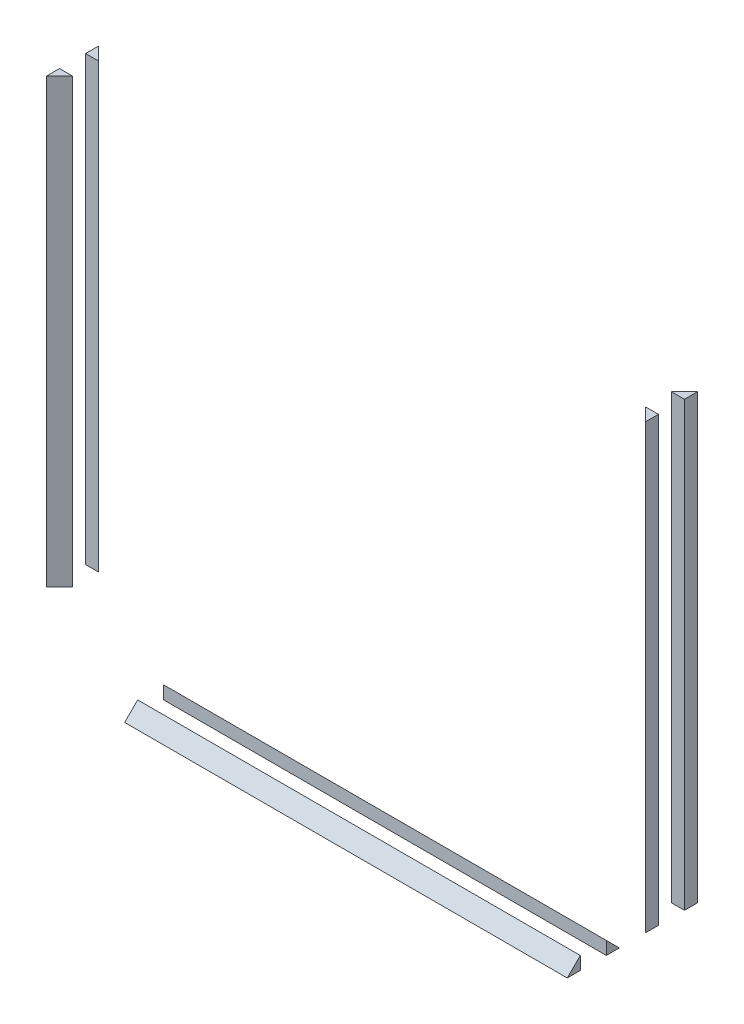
ISO-10303-21;
HEADER;
FILE_DESCRIPTION(('STEP AP214'),'2;1');
FILE_NAME('part.step','',(''),(''),'','','');
FILE_SCHEMA(('AUTOMOTIVE_DESIGN { 1 0 10303 214 1 1 1 1 }'));
ENDSEC;
DATA;
#1=APPLICATION_CONTEXT('core data for automotive mechanical design processes');
#2=APPLICATION_PROTOCOL_DEFINITION('international standard','automotive_design',2000,#1);
#3=PRODUCT_CONTEXT('',#1,'mechanical');
#4=PRODUCT('Part','Part','',(#3));
#5=PRODUCT_RELATED_PRODUCT_CATEGORY('part','',(#4));
#6=PRODUCT_DEFINITION_FORMATION('','',#4);
#7=PRODUCT_DEFINITION_CONTEXT('part definition',#1,'design');
#8=PRODUCT_DEFINITION('design','',#6,#7);
#9=PRODUCT_DEFINITION_SHAPE('','',#8);
#10=(LENGTH_UNIT() NAMED_UNIT(*) SI_UNIT(.MILLI.,.METRE.));
#11=(NAMED_UNIT(*) PLANE_ANGLE_UNIT() SI_UNIT($,.RADIAN.));
#12=(NAMED_UNIT(*) SI_UNIT($,.STERADIAN.) SOLID_ANGLE_UNIT());
#13=UNCERTAINTY_MEASURE_WITH_UNIT(LENGTH_MEASURE(1.E-05),#10,'distance_accuracy_value','');
#14=(GEOMETRIC_REPRESENTATION_CONTEXT(3) GLOBAL_UNCERTAINTY_ASSIGNED_CONTEXT((#13)) GLOBAL_UNIT_ASSIGNED_CONTEXT((#10,
#11,#12)) REPRESENTATION_CONTEXT('',''));
#15=CARTESIAN_POINT('',(0.,0.,0.));
#16=DIRECTION('',(0.,0.,1.));
#17=DIRECTION('',(1.,0.,0.));
#18=AXIS2_PLACEMENT_3D('',#15,#16,#17);
#19=CARTESIAN_POINT('',(-51.0408701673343,-144.079320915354,4.99999999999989));
#20=DIRECTION('',(0.,1.,0.));
#21=DIRECTION('',(0.,0.,1.));
#22=AXIS2_PLACEMENT_3D('',#19,#20,#21);
#23=PLANE('',#22);
#24=DIRECTION('',(0.,0.,-1.));
#25=VECTOR('',#24,1.);
#26=CARTESIAN_POINT('',(-51.0408701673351,-144.079320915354,0.));
#27=LINE('',#26,#25);
#28=CARTESIAN_POINT('',(-51.0408701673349,-144.079320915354,5.00000000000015));
#29=VERTEX_POINT('',#28);
#30=CARTESIAN_POINT('',(-51.0408701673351,-144.079320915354,-1.08900307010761E-13));
#31=VERTEX_POINT('',#30);
#32=EDGE_CURVE('P0_E56',#29,#31,#27,.T.);
#33=ORIENTED_EDGE('',*,*,#32,.T.);
#34=DIRECTION('',(-0.707106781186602,0.,-0.707106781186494));
#35=VECTOR('',#34,1.);
#36=CARTESIAN_POINT('',(-46.0408701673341,-144.079320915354,5.00000000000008));
#37=LINE('',#36,#35);
#38=CARTESIAN_POINT('',(-46.0408701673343,-144.079320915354,4.99999999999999));
#39=VERTEX_POINT('',#38);
#40=EDGE_CURVE('P0_E20',#39,#31,#37,.T.);
#41=ORIENTED_EDGE('',*,*,#40,.F.);
#42=DIRECTION('',(-1.,0.,0.));
#43=VECTOR('',#42,1.);
#44=CARTESIAN_POINT('',(63.9591298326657,-144.079320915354,5.00000000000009));
#45=LINE('',#44,#43);
#46=EDGE_CURVE('P0_E62',#39,#29,#45,.T.);
#47=ORIENTED_EDGE('',*,*,#46,.T.);
#48=EDGE_LOOP('',(#33,#41,#47));
#49=FACE_BOUND('',#48,.T.);
#50=ADVANCED_FACE('P0_F16',(#49),#23,.F.);
#51=CARTESIAN_POINT('',(-51.0408701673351,25.9206790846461,0.));
#52=DIRECTION('',(1.,0.,0.));
#53=DIRECTION('',(0.,0.,-1.));
#54=AXIS2_PLACEMENT_3D('',#51,#52,#53);
#55=PLANE('',#54);
#56=DIRECTION('',(0.,1.,0.));
#57=VECTOR('',#56,1.);
#58=CARTESIAN_POINT('',(-51.0408701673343,-53.9321994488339,5.00000000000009));
#59=LINE('',#58,#57);
#60=CARTESIAN_POINT('',(-51.0408701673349,25.9206790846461,5.00000000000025));
#61=VERTEX_POINT('',#60);
#62=EDGE_CURVE('P0_E54',#29,#61,#59,.T.);
#63=ORIENTED_EDGE('',*,*,#62,.T.);
#64=DIRECTION('',(0.,0.,1.));
#65=VECTOR('',#64,1.);
#66=CARTESIAN_POINT('',(-51.0408701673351,25.9206790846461,5.0000000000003));
#67=LINE('',#66,#65);
#68=CARTESIAN_POINT('',(-51.0408701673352,25.9206790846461,0.));
#69=VERTEX_POINT('',#68);
#70=EDGE_CURVE('P0_E60',#69,#61,#67,.T.);
#71=ORIENTED_EDGE('',*,*,#70,.F.);
#72=DIRECTION('',(0.,1.,0.));
#73=VECTOR('',#72,1.);
#74=CARTESIAN_POINT('',(-51.0408701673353,25.9206790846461,1.12757025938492E-13));
#75=LINE('',#74,#73);
#76=EDGE_CURVE('P0_E59',#31,#69,#75,.T.);
#77=ORIENTED_EDGE('',*,*,#76,.F.);
#78=ORIENTED_EDGE('',*,*,#32,.F.);
#79=EDGE_LOOP('',(#63,#71,#77,#78));
#80=FACE_BOUND('',#79,.T.);
#81=ADVANCED_FACE('P0_F57',(#80),#55,.F.);
#82=CARTESIAN_POINT('',(-51.0408701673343,25.9206790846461,5.0000000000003));
#83=DIRECTION('',(0.,1.,0.));
#84=DIRECTION('',(0.,0.,1.));
#85=AXIS2_PLACEMENT_3D('',#82,#83,#84);
#86=PLANE('',#85);
#87=DIRECTION('',(-0.707106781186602,0.,-0.707106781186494));
#88=VECTOR('',#87,1.);
#89=CARTESIAN_POINT('',(-46.0408701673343,25.9206790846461,5.0000000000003));
#90=LINE('',#89,#88);
#91=CARTESIAN_POINT('',(-46.0408701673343,25.9206790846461,5.00000000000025));
#92=VERTEX_POINT('',#91);
#93=EDGE_CURVE('P0_E26',#69,#92,#90,.F.);
#94=ORIENTED_EDGE('',*,*,#93,.F.);
#95=ORIENTED_EDGE('',*,*,#70,.T.);
#96=DIRECTION('',(-1.,0.,0.));
#97=VECTOR('',#96,1.);
#98=CARTESIAN_POINT('',(63.9591298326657,25.9206790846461,5.00000000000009));
#99=LINE('',#98,#97);
#100=EDGE_CURVE('P0_E35',#61,#92,#99,.F.);
#101=ORIENTED_EDGE('',*,*,#100,.T.);
#102=EDGE_LOOP('',(#94,#95,#101));
#103=FACE_BOUND('',#102,.T.);
#104=ADVANCED_FACE('P0_F72',(#103),#86,.T.);
#105=CARTESIAN_POINT('',(63.9591298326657,-53.9321994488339,5.00000000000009));
#106=DIRECTION('',(0.,0.,-1.));
#107=DIRECTION('',(-1.,0.,0.));
#108=AXIS2_PLACEMENT_3D('',#105,#106,#107);
#109=PLANE('',#108);
#110=DIRECTION('',(0.,1.,0.));
#111=VECTOR('',#110,1.);
#112=CARTESIAN_POINT('',(-46.0408701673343,25.9206790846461,5.0000000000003));
#113=LINE('',#112,#111);
#114=EDGE_CURVE('P0_E10',#92,#39,#113,.F.);
#115=ORIENTED_EDGE('',*,*,#114,.F.);
#116=ORIENTED_EDGE('',*,*,#100,.F.);
#117=ORIENTED_EDGE('',*,*,#62,.F.);
#118=ORIENTED_EDGE('',*,*,#46,.F.);
#119=EDGE_LOOP('',(#115,#116,#117,#118));
#120=FACE_BOUND('',#119,.T.);
#121=ADVANCED_FACE('P0_F65',(#120),#109,.F.);
#122=CARTESIAN_POINT('',(-46.0408701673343,25.9206790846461,5.0000000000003));
#123=DIRECTION('',(0.707106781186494,0.,-0.707106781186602));
#124=DIRECTION('',(-0.707106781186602,0.,-0.707106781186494));
#125=AXIS2_PLACEMENT_3D('',#122,#123,#124);
#126=PLANE('',#125);
#127=ORIENTED_EDGE('',*,*,#93,.T.);
#128=ORIENTED_EDGE('',*,*,#114,.T.);
#129=ORIENTED_EDGE('',*,*,#40,.T.);
#130=ORIENTED_EDGE('',*,*,#76,.T.);
#131=EDGE_LOOP('',(#127,#128,#129,#130));
#132=FACE_BOUND('',#131,.T.);
#133=ADVANCED_FACE('P0_F18',(#132),#126,.T.);
#134=CLOSED_SHELL('',(#50,#81,#104,#121,#133));
#135=MANIFOLD_SOLID_BREP('P0_B1',#134);
#136=CARTESIAN_POINT('',(178.959129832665,25.920679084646,5.00000000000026));
#137=DIRECTION('',(0.,1.,0.));
#138=DIRECTION('',(0.,0.,1.));
#139=AXIS2_PLACEMENT_3D('',#136,#137,#138);
#140=PLANE('',#139);
#141=DIRECTION('',(-0.707106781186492,0.,0.707106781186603));
#142=VECTOR('',#141,1.);
#143=CARTESIAN_POINT('',(173.959129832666,25.9206790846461,5.00000000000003));
#144=LINE('',#143,#142);
#145=CARTESIAN_POINT('',(173.959129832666,25.9206790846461,5.00000000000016));
#146=VERTEX_POINT('',#145);
#147=CARTESIAN_POINT('',(178.959129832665,25.9206790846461,2.50072324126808E-13));
#148=VERTEX_POINT('',#147);
#149=EDGE_CURVE('P1_E20',#146,#148,#144,.F.);
#150=ORIENTED_EDGE('',*,*,#149,.F.);
#151=DIRECTION('',(-1.,0.,0.));
#152=VECTOR('',#151,1.);
#153=CARTESIAN_POINT('',(63.9591298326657,25.920679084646,5.00000000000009));
#154=LINE('',#153,#152);
#155=CARTESIAN_POINT('',(178.959129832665,25.9206790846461,5.00000000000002));
#156=VERTEX_POINT('',#155);
#157=EDGE_CURVE('P1_E62',#146,#156,#154,.F.);
#158=ORIENTED_EDGE('',*,*,#157,.T.);
#159=DIRECTION('',(0.,0.,1.));
#160=VECTOR('',#159,1.);
#161=CARTESIAN_POINT('',(178.959129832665,25.9206790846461,0.));
#162=LINE('',#161,#160);
#163=EDGE_CURVE('P1_E56',#156,#148,#162,.F.);
#164=ORIENTED_EDGE('',*,*,#163,.T.);
#165=EDGE_LOOP('',(#150,#158,#164));
#166=FACE_BOUND('',#165,.T.);
#167=ADVANCED_FACE('P1_F16',(#166),#140,.T.);
#168=CARTESIAN_POINT('',(178.959129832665,-169.079320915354,0.));
#169=DIRECTION('',(-1.,0.,0.));
#170=DIRECTION('',(0.,0.,1.));
#171=AXIS2_PLACEMENT_3D('',#168,#169,#170);
#172=PLANE('',#171);
#173=DIRECTION('',(0.,1.,0.));
#174=VECTOR('',#173,1.);
#175=CARTESIAN_POINT('',(178.959129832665,-144.079320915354,0.));
#176=LINE('',#175,#174);
#177=CARTESIAN_POINT('',(178.959129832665,-144.079320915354,0.));
#178=VERTEX_POINT('',#177);
#179=EDGE_CURVE('P1_E59',#148,#178,#176,.F.);
#180=ORIENTED_EDGE('',*,*,#179,.F.);
#181=ORIENTED_EDGE('',*,*,#163,.F.);
#182=DIRECTION('',(0.,1.,0.));
#183=VECTOR('',#182,1.);
#184=CARTESIAN_POINT('',(178.959129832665,-53.9321994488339,5.00000000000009));
#185=LINE('',#184,#183);
#186=CARTESIAN_POINT('',(178.959129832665,-144.079320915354,4.99999999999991));
#187=VERTEX_POINT('',#186);
#188=EDGE_CURVE('P1_E54',#156,#187,#185,.F.);
#189=ORIENTED_EDGE('',*,*,#188,.T.);
#190=DIRECTION('',(0.,0.,1.));
#191=VECTOR('',#190,1.);
#192=CARTESIAN_POINT('',(178.959129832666,-144.079320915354,4.99999999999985));
#193=LINE('',#192,#191);
#194=EDGE_CURVE('P1_E60',#187,#178,#193,.F.);
#195=ORIENTED_EDGE('',*,*,#194,.T.);
#196=EDGE_LOOP('',(#180,#181,#189,#195));
#197=FACE_BOUND('',#196,.T.);
#198=ADVANCED_FACE('P1_F57',(#197),#172,.F.);
#199=CARTESIAN_POINT('',(178.959129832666,-144.079320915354,4.99999999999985));
#200=DIRECTION('',(0.,1.,0.));
#201=DIRECTION('',(0.,0.,1.));
#202=AXIS2_PLACEMENT_3D('',#199,#200,#201);
#203=PLANE('',#202);
#204=DIRECTION('',(-1.,0.,0.));
#205=VECTOR('',#204,1.);
#206=CARTESIAN_POINT('',(63.9591298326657,-144.079320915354,5.00000000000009));
#207=LINE('',#206,#205);
#208=CARTESIAN_POINT('',(173.959129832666,-144.079320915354,4.99999999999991));
#209=VERTEX_POINT('',#208);
#210=EDGE_CURVE('P1_E35',#187,#209,#207,.T.);
#211=ORIENTED_EDGE('',*,*,#210,.T.);
#212=DIRECTION('',(-0.707106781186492,0.,0.707106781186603));
#213=VECTOR('',#212,1.);
#214=CARTESIAN_POINT('',(173.959129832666,-144.079320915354,4.99999999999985));
#215=LINE('',#214,#213);
#216=EDGE_CURVE('P1_E26',#178,#209,#215,.T.);
#217=ORIENTED_EDGE('',*,*,#216,.F.);
#218=ORIENTED_EDGE('',*,*,#194,.F.);
#219=EDGE_LOOP('',(#211,#217,#218));
#220=FACE_BOUND('',#219,.T.);
#221=ADVANCED_FACE('P1_F72',(#220),#203,.F.);
#222=CARTESIAN_POINT('',(63.9591298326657,-53.9321994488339,5.00000000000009));
#223=DIRECTION('',(0.,0.,-1.));
#224=DIRECTION('',(-1.,0.,0.));
#225=AXIS2_PLACEMENT_3D('',#222,#223,#224);
#226=PLANE('',#225);
#227=DIRECTION('',(0.,1.,0.));
#228=VECTOR('',#227,1.);
#229=CARTESIAN_POINT('',(173.959129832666,-144.079320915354,4.99999999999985));
#230=LINE('',#229,#228);
#231=EDGE_CURVE('P1_E10',#209,#146,#230,.T.);
#232=ORIENTED_EDGE('',*,*,#231,.F.);
#233=ORIENTED_EDGE('',*,*,#210,.F.);
#234=ORIENTED_EDGE('',*,*,#188,.F.);
#235=ORIENTED_EDGE('',*,*,#157,.F.);
#236=EDGE_LOOP('',(#232,#233,#234,#235));
#237=FACE_BOUND('',#236,.T.);
#238=ADVANCED_FACE('P1_F65',(#237),#226,.F.);
#239=CARTESIAN_POINT('',(173.959129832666,-144.079320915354,4.99999999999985));
#240=DIRECTION('',(-0.707106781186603,0.,-0.707106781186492));
#241=DIRECTION('',(-0.707106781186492,0.,0.707106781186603));
#242=AXIS2_PLACEMENT_3D('',#239,#240,#241);
#243=PLANE('',#242);
#244=ORIENTED_EDGE('',*,*,#216,.T.);
#245=ORIENTED_EDGE('',*,*,#231,.T.);
#246=ORIENTED_EDGE('',*,*,#149,.T.);
#247=ORIENTED_EDGE('',*,*,#179,.T.);
#248=EDGE_LOOP('',(#244,#245,#246,#247));
#249=FACE_BOUND('',#248,.T.);
#250=ADVANCED_FACE('P1_F18',(#249),#243,.T.);
#251=CLOSED_SHELL('',(#167,#198,#221,#238,#250));
#252=MANIFOLD_SOLID_BREP('P1_B1',#251);
#253=CARTESIAN_POINT('',(148.959129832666,-174.079320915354,14.9999999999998));
#254=DIRECTION('',(1.,0.,0.));
#255=DIRECTION('',(0.,0.,-1.));
#256=AXIS2_PLACEMENT_3D('',#253,#254,#255);
#257=PLANE('',#256);
#258=DIRECTION('',(0.,1.,0.));
#259=VECTOR('',#258,1.);
#260=CARTESIAN_POINT('',(148.959129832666,-53.9321994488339,15.0000000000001));
#261=LINE('',#260,#259);
#262=CARTESIAN_POINT('',(148.959129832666,-169.079320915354,14.9999999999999));
#263=VERTEX_POINT('',#262);
#264=CARTESIAN_POINT('',(148.959129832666,-174.079320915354,14.9999999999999));
#265=VERTEX_POINT('',#264);
#266=EDGE_CURVE('P2_E56',#263,#265,#261,.F.);
#267=ORIENTED_EDGE('',*,*,#266,.F.);
#268=DIRECTION('',(0.,-0.707106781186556,0.707106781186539));
#269=VECTOR('',#268,1.);
#270=CARTESIAN_POINT('',(148.959129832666,-174.079320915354,19.9999999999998));
#271=LINE('',#270,#269);
#272=CARTESIAN_POINT('',(148.959129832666,-174.079320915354,19.9999999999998));
#273=VERTEX_POINT('',#272);
#274=EDGE_CURVE('P2_E20',#273,#263,#271,.F.);
#275=ORIENTED_EDGE('',*,*,#274,.F.);
#276=DIRECTION('',(0.,0.,1.));
#277=VECTOR('',#276,1.);
#278=CARTESIAN_POINT('',(148.959129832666,-174.079320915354,0.));
#279=LINE('',#278,#277);
#280=EDGE_CURVE('P2_E62',#273,#265,#279,.F.);
#281=ORIENTED_EDGE('',*,*,#280,.T.);
#282=EDGE_LOOP('',(#267,#275,#281));
#283=FACE_BOUND('',#282,.T.);
#284=ADVANCED_FACE('P2_F16',(#283),#257,.T.);
#285=CARTESIAN_POINT('',(63.9591298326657,-53.9321994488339,15.0000000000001));
#286=DIRECTION('',(0.,0.,-1.));
#287=DIRECTION('',(-1.,0.,0.));
#288=AXIS2_PLACEMENT_3D('',#285,#286,#287);
#289=PLANE('',#288);
#290=DIRECTION('',(0.,1.,0.));
#291=VECTOR('',#290,1.);
#292=CARTESIAN_POINT('',(-21.0408701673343,-174.079320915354,14.9999999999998));
#293=LINE('',#292,#291);
#294=CARTESIAN_POINT('',(-21.0408701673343,-174.079320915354,14.9999999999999));
#295=VERTEX_POINT('',#294);
#296=CARTESIAN_POINT('',(-21.0408701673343,-169.079320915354,14.9999999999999));
#297=VERTEX_POINT('',#296);
#298=EDGE_CURVE('P2_E60',#295,#297,#293,.T.);
#299=ORIENTED_EDGE('',*,*,#298,.T.);
#300=DIRECTION('',(1.,0.,0.));
#301=VECTOR('',#300,1.);
#302=CARTESIAN_POINT('',(-21.0408701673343,-169.079320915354,14.9999999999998));
#303=LINE('',#302,#301);
#304=EDGE_CURVE('P2_E59',#263,#297,#303,.F.);
#305=ORIENTED_EDGE('',*,*,#304,.F.);
#306=ORIENTED_EDGE('',*,*,#266,.T.);
#307=DIRECTION('',(1.,0.,0.));
#308=VECTOR('',#307,1.);
#309=CARTESIAN_POINT('',(-46.0408701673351,-174.079320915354,14.9999999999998));
#310=LINE('',#309,#308);
#311=EDGE_CURVE('P2_E54',#265,#295,#310,.F.);
#312=ORIENTED_EDGE('',*,*,#311,.T.);
#313=EDGE_LOOP('',(#299,#305,#306,#312));
#314=FACE_BOUND('',#313,.T.);
#315=ADVANCED_FACE('P2_F57',(#314),#289,.T.);
#316=CARTESIAN_POINT('',(-21.0408701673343,-174.079320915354,14.9999999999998));
#317=DIRECTION('',(1.,0.,0.));
#318=DIRECTION('',(0.,0.,-1.));
#319=AXIS2_PLACEMENT_3D('',#316,#317,#318);
#320=PLANE('',#319);
#321=DIRECTION('',(0.,-0.707106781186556,0.707106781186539));
#322=VECTOR('',#321,1.);
#323=CARTESIAN_POINT('',(-21.0408701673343,-174.079320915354,19.9999999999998));
#324=LINE('',#323,#322);
#325=CARTESIAN_POINT('',(-21.0408701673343,-174.079320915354,19.9999999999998));
#326=VERTEX_POINT('',#325);
#327=EDGE_CURVE('P2_E26',#297,#326,#324,.T.);
#328=ORIENTED_EDGE('',*,*,#327,.F.);
#329=ORIENTED_EDGE('',*,*,#298,.F.);
#330=DIRECTION('',(0.,0.,1.));
#331=VECTOR('',#330,1.);
#332=CARTESIAN_POINT('',(-21.0408701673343,-174.079320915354,0.));
#333=LINE('',#332,#331);
#334=EDGE_CURVE('P2_E35',#295,#326,#333,.T.);
#335=ORIENTED_EDGE('',*,*,#334,.T.);
#336=EDGE_LOOP('',(#328,#329,#335));
#337=FACE_BOUND('',#336,.T.);
#338=ADVANCED_FACE('P2_F72',(#337),#320,.F.);
#339=CARTESIAN_POINT('',(-46.0408701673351,-174.079320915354,0.));
#340=DIRECTION('',(0.,1.,0.));
#341=DIRECTION('',(0.,0.,1.));
#342=AXIS2_PLACEMENT_3D('',#339,#340,#341);
#343=PLANE('',#342);
#344=DIRECTION('',(1.,0.,0.));
#345=VECTOR('',#344,1.);
#346=CARTESIAN_POINT('',(-21.0408701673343,-174.079320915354,19.9999999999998));
#347=LINE('',#346,#345);
#348=EDGE_CURVE('P2_E10',#326,#273,#347,.T.);
#349=ORIENTED_EDGE('',*,*,#348,.F.);
#350=ORIENTED_EDGE('',*,*,#334,.F.);
#351=ORIENTED_EDGE('',*,*,#311,.F.);
#352=ORIENTED_EDGE('',*,*,#280,.F.);
#353=EDGE_LOOP('',(#349,#350,#351,#352));
#354=FACE_BOUND('',#353,.T.);
#355=ADVANCED_FACE('P2_F65',(#354),#343,.F.);
#356=CARTESIAN_POINT('',(-21.0408701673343,-174.079320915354,19.9999999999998));
#357=DIRECTION('',(0.,0.707106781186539,0.707106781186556));
#358=DIRECTION('',(0.,-0.707106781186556,0.707106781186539));
#359=AXIS2_PLACEMENT_3D('',#356,#357,#358);
#360=PLANE('',#359);
#361=ORIENTED_EDGE('',*,*,#327,.T.);
#362=ORIENTED_EDGE('',*,*,#348,.T.);
#363=ORIENTED_EDGE('',*,*,#274,.T.);
#364=ORIENTED_EDGE('',*,*,#304,.T.);
#365=EDGE_LOOP('',(#361,#362,#363,#364));
#366=FACE_BOUND('',#365,.T.);
#367=ADVANCED_FACE('P2_F18',(#366),#360,.T.);
#368=CLOSED_SHELL('',(#284,#315,#338,#355,#367));
#369=MANIFOLD_SOLID_BREP('P2_B1',#368);
#370=CARTESIAN_POINT('',(178.959129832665,25.9206790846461,15.0000000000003));
#371=DIRECTION('',(0.,1.,0.));
#372=DIRECTION('',(0.,0.,1.));
#373=AXIS2_PLACEMENT_3D('',#370,#371,#372);
#374=PLANE('',#373);
#375=DIRECTION('',(-1.,0.,0.));
#376=VECTOR('',#375,1.);
#377=CARTESIAN_POINT('',(63.9591298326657,25.9206790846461,15.0000000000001));
#378=LINE('',#377,#376);
#379=CARTESIAN_POINT('',(173.959129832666,25.9206790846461,15.0000000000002));
#380=VERTEX_POINT('',#379);
#381=CARTESIAN_POINT('',(178.959129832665,25.9206790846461,15.0000000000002));
#382=VERTEX_POINT('',#381);
#383=EDGE_CURVE('P3_E56',#380,#382,#378,.F.);
#384=ORIENTED_EDGE('',*,*,#383,.F.);
#385=DIRECTION('',(0.707106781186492,0.,0.707106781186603));
#386=VECTOR('',#385,1.);
#387=CARTESIAN_POINT('',(178.959129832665,25.9206790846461,20.0000000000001));
#388=LINE('',#387,#386);
#389=CARTESIAN_POINT('',(178.959129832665,25.9206790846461,20.0000000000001));
#390=VERTEX_POINT('',#389);
#391=EDGE_CURVE('P3_E20',#390,#380,#388,.F.);
#392=ORIENTED_EDGE('',*,*,#391,.F.);
#393=DIRECTION('',(0.,0.,1.));
#394=VECTOR('',#393,1.);
#395=CARTESIAN_POINT('',(178.959129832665,25.920679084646,0.));
#396=LINE('',#395,#394);
#397=EDGE_CURVE('P3_E55',#390,#382,#396,.F.);
#398=ORIENTED_EDGE('',*,*,#397,.T.);
#399=EDGE_LOOP('',(#384,#392,#398));
#400=FACE_BOUND('',#399,.T.);
#401=ADVANCED_FACE('P3_F16',(#400),#374,.T.);
#402=CARTESIAN_POINT('',(63.9591298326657,-53.9321994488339,15.0000000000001));
#403=DIRECTION('',(0.,0.,-1.));
#404=DIRECTION('',(-1.,0.,0.));
#405=AXIS2_PLACEMENT_3D('',#402,#403,#404);
#406=PLANE('',#405);
#407=DIRECTION('',(1.,0.,0.));
#408=VECTOR('',#407,1.);
#409=CARTESIAN_POINT('',(178.959129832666,-144.079320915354,14.9999999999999));
#410=LINE('',#409,#408);
#411=CARTESIAN_POINT('',(178.959129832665,-144.079320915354,15.0000000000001));
#412=VERTEX_POINT('',#411);
#413=CARTESIAN_POINT('',(173.959129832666,-144.079320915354,15.));
#414=VERTEX_POINT('',#413);
#415=EDGE_CURVE('P3_E59',#412,#414,#410,.F.);
#416=ORIENTED_EDGE('',*,*,#415,.T.);
#417=DIRECTION('',(0.,1.,0.));
#418=VECTOR('',#417,1.);
#419=CARTESIAN_POINT('',(173.959129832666,-144.079320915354,15.));
#420=LINE('',#419,#418);
#421=EDGE_CURVE('P3_E63',#380,#414,#420,.F.);
#422=ORIENTED_EDGE('',*,*,#421,.F.);
#423=ORIENTED_EDGE('',*,*,#383,.T.);
#424=DIRECTION('',(0.,1.,0.));
#425=VECTOR('',#424,1.);
#426=CARTESIAN_POINT('',(178.959129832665,-169.079320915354,15.0000000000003));
#427=LINE('',#426,#425);
#428=EDGE_CURVE('P3_E54',#382,#412,#427,.F.);
#429=ORIENTED_EDGE('',*,*,#428,.T.);
#430=EDGE_LOOP('',(#416,#422,#423,#429));
#431=FACE_BOUND('',#430,.T.);
#432=ADVANCED_FACE('P3_F61',(#431),#406,.T.);
#433=CARTESIAN_POINT('',(178.959129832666,-144.079320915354,14.9999999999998));
#434=DIRECTION('',(0.,1.,0.));
#435=DIRECTION('',(0.,0.,1.));
#436=AXIS2_PLACEMENT_3D('',#433,#434,#435);
#437=PLANE('',#436);
#438=DIRECTION('',(0.707106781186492,0.,0.707106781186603));
#439=VECTOR('',#438,1.);
#440=CARTESIAN_POINT('',(178.959129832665,-144.079320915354,19.9999999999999));
#441=LINE('',#440,#439);
#442=CARTESIAN_POINT('',(178.959129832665,-144.079320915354,19.9999999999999));
#443=VERTEX_POINT('',#442);
#444=EDGE_CURVE('P3_E26',#414,#443,#441,.T.);
#445=ORIENTED_EDGE('',*,*,#444,.F.);
#446=ORIENTED_EDGE('',*,*,#415,.F.);
#447=DIRECTION('',(0.,0.,1.));
#448=VECTOR('',#447,1.);
#449=CARTESIAN_POINT('',(178.959129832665,-144.079320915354,0.));
#450=LINE('',#449,#448);
#451=EDGE_CURVE('P3_E35',#412,#443,#450,.T.);
#452=ORIENTED_EDGE('',*,*,#451,.T.);
#453=EDGE_LOOP('',(#445,#446,#452));
#454=FACE_BOUND('',#453,.T.);
#455=ADVANCED_FACE('P3_F72',(#454),#437,.F.);
#456=CARTESIAN_POINT('',(178.959129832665,-169.079320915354,0.));
#457=DIRECTION('',(-1.,0.,0.));
#458=DIRECTION('',(0.,0.,1.));
#459=AXIS2_PLACEMENT_3D('',#456,#457,#458);
#460=PLANE('',#459);
#461=ORIENTED_EDGE('',*,*,#451,.F.);
#462=ORIENTED_EDGE('',*,*,#428,.F.);
#463=ORIENTED_EDGE('',*,*,#397,.F.);
#464=DIRECTION('',(0.,1.,0.));
#465=VECTOR('',#464,1.);
#466=CARTESIAN_POINT('',(178.959129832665,-144.079320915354,19.9999999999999));
#467=LINE('',#466,#465);
#468=EDGE_CURVE('P3_E10',#443,#390,#467,.T.);
#469=ORIENTED_EDGE('',*,*,#468,.F.);
#470=EDGE_LOOP('',(#461,#462,#463,#469));
#471=FACE_BOUND('',#470,.T.);
#472=ADVANCED_FACE('P3_F65',(#471),#460,.F.);
#473=CARTESIAN_POINT('',(178.959129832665,-144.079320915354,19.9999999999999));
#474=DIRECTION('',(-0.707106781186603,0.,0.707106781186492));
#475=DIRECTION('',(0.707106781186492,0.,0.707106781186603));
#476=AXIS2_PLACEMENT_3D('',#473,#474,#475);
#477=PLANE('',#476);
#478=ORIENTED_EDGE('',*,*,#444,.T.);
#479=ORIENTED_EDGE('',*,*,#468,.T.);
#480=ORIENTED_EDGE('',*,*,#391,.T.);
#481=ORIENTED_EDGE('',*,*,#421,.T.);
#482=EDGE_LOOP('',(#478,#479,#480,#481));
#483=FACE_BOUND('',#482,.T.);
#484=ADVANCED_FACE('P3_F18',(#483),#477,.T.);
#485=CLOSED_SHELL('',(#401,#432,#455,#472,#484));
#486=MANIFOLD_SOLID_BREP('P3_B1',#485);
#487=CARTESIAN_POINT('',(148.959129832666,-174.079320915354,4.99999999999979));
#488=DIRECTION('',(1.,0.,0.));
#489=DIRECTION('',(0.,0.,-1.));
#490=AXIS2_PLACEMENT_3D('',#487,#488,#489);
#491=PLANE('',#490);
#492=DIRECTION('',(0.,0.707106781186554,0.707106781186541));
#493=VECTOR('',#492,1.);
#494=CARTESIAN_POINT('',(148.959129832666,-169.079320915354,4.99999999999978));
#495=LINE('',#494,#493);
#496=CARTESIAN_POINT('',(148.959129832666,-169.079320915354,4.99999999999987));
#497=VERTEX_POINT('',#496);
#498=CARTESIAN_POINT('',(148.959129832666,-174.079320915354,-1.59499176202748E-13));
#499=VERTEX_POINT('',#498);
#500=EDGE_CURVE('P4_E20',#497,#499,#495,.F.);
#501=ORIENTED_EDGE('',*,*,#500,.F.);
#502=DIRECTION('',(0.,1.,0.));
#503=VECTOR('',#502,1.);
#504=CARTESIAN_POINT('',(148.959129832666,-53.9321994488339,5.00000000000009));
#505=LINE('',#504,#503);
#506=CARTESIAN_POINT('',(148.959129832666,-174.079320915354,4.99999999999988));
#507=VERTEX_POINT('',#506);
#508=EDGE_CURVE('P4_E62',#497,#507,#505,.F.);
#509=ORIENTED_EDGE('',*,*,#508,.T.);
#510=DIRECTION('',(0.,0.,1.));
#511=VECTOR('',#510,1.);
#512=CARTESIAN_POINT('',(148.959129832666,-174.079320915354,0.));
#513=LINE('',#512,#511);
#514=EDGE_CURVE('P4_E56',#507,#499,#513,.F.);
#515=ORIENTED_EDGE('',*,*,#514,.T.);
#516=EDGE_LOOP('',(#501,#509,#515));
#517=FACE_BOUND('',#516,.T.);
#518=ADVANCED_FACE('P4_F16',(#517),#491,.T.);
#519=CARTESIAN_POINT('',(-46.0408701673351,-174.079320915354,0.));
#520=DIRECTION('',(0.,1.,0.));
#521=DIRECTION('',(0.,0.,1.));
#522=AXIS2_PLACEMENT_3D('',#519,#520,#521);
#523=PLANE('',#522);
#524=DIRECTION('',(-1.,0.,0.));
#525=VECTOR('',#524,1.);
#526=CARTESIAN_POINT('',(63.9591298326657,-174.079320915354,5.00000000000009));
#527=LINE('',#526,#525);
#528=CARTESIAN_POINT('',(-21.0408701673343,-174.079320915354,4.99999999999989));
#529=VERTEX_POINT('',#528);
#530=EDGE_CURVE('P4_E54',#507,#529,#527,.T.);
#531=ORIENTED_EDGE('',*,*,#530,.T.);
#532=DIRECTION('',(0.,0.,-1.));
#533=VECTOR('',#532,1.);
#534=CARTESIAN_POINT('',(-21.0408701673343,-174.079320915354,4.99999999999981));
#535=LINE('',#534,#533);
#536=CARTESIAN_POINT('',(-21.0408701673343,-174.079320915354,-1.6726354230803E-13));
#537=VERTEX_POINT('',#536);
#538=EDGE_CURVE('P4_E60',#529,#537,#535,.T.);
#539=ORIENTED_EDGE('',*,*,#538,.T.);
#540=DIRECTION('',(1.,0.,0.));
#541=VECTOR('',#540,1.);
#542=CARTESIAN_POINT('',(-21.0408701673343,-174.079320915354,-1.62196645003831E-13));
#543=LINE('',#542,#541);
#544=EDGE_CURVE('P4_E59',#499,#537,#543,.F.);
#545=ORIENTED_EDGE('',*,*,#544,.F.);
#546=ORIENTED_EDGE('',*,*,#514,.F.);
#547=EDGE_LOOP('',(#531,#539,#545,#546));
#548=FACE_BOUND('',#547,.T.);
#549=ADVANCED_FACE('P4_F57',(#548),#523,.F.);
#550=CARTESIAN_POINT('',(-21.0408701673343,-174.079320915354,4.99999999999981));
#551=DIRECTION('',(1.,0.,0.));
#552=DIRECTION('',(0.,0.,-1.));
#553=AXIS2_PLACEMENT_3D('',#550,#551,#552);
#554=PLANE('',#553);
#555=DIRECTION('',(0.,1.,0.));
#556=VECTOR('',#555,1.);
#557=CARTESIAN_POINT('',(-21.0408701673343,-53.9321994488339,5.00000000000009));
#558=LINE('',#557,#556);
#559=CARTESIAN_POINT('',(-21.0408701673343,-169.079320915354,4.99999999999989));
#560=VERTEX_POINT('',#559);
#561=EDGE_CURVE('P4_E35',#529,#560,#558,.T.);
#562=ORIENTED_EDGE('',*,*,#561,.T.);
#563=DIRECTION('',(0.,0.707106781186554,0.707106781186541));
#564=VECTOR('',#563,1.);
#565=CARTESIAN_POINT('',(-21.0408701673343,-169.079320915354,4.99999999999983));
#566=LINE('',#565,#564);
#567=EDGE_CURVE('P4_E26',#537,#560,#566,.T.);
#568=ORIENTED_EDGE('',*,*,#567,.F.);
#569=ORIENTED_EDGE('',*,*,#538,.F.);
#570=EDGE_LOOP('',(#562,#568,#569));
#571=FACE_BOUND('',#570,.T.);
#572=ADVANCED_FACE('P4_F72',(#571),#554,.F.);
#573=CARTESIAN_POINT('',(63.9591298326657,-53.9321994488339,5.00000000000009));
#574=DIRECTION('',(0.,0.,-1.));
#575=DIRECTION('',(-1.,0.,0.));
#576=AXIS2_PLACEMENT_3D('',#573,#574,#575);
#577=PLANE('',#576);
#578=DIRECTION('',(1.,0.,0.));
#579=VECTOR('',#578,1.);
#580=CARTESIAN_POINT('',(-21.0408701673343,-169.079320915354,4.99999999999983));
#581=LINE('',#580,#579);
#582=EDGE_CURVE('P4_E10',#560,#497,#581,.T.);
#583=ORIENTED_EDGE('',*,*,#582,.F.);
#584=ORIENTED_EDGE('',*,*,#561,.F.);
#585=ORIENTED_EDGE('',*,*,#530,.F.);
#586=ORIENTED_EDGE('',*,*,#508,.F.);
#587=EDGE_LOOP('',(#583,#584,#585,#586));
#588=FACE_BOUND('',#587,.T.);
#589=ADVANCED_FACE('P4_F65',(#588),#577,.F.);
#590=CARTESIAN_POINT('',(-21.0408701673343,-169.079320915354,4.99999999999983));
#591=DIRECTION('',(0.,0.707106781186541,-0.707106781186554));
#592=DIRECTION('',(0.,0.707106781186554,0.707106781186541));
#593=AXIS2_PLACEMENT_3D('',#590,#591,#592);
#594=PLANE('',#593);
#595=ORIENTED_EDGE('',*,*,#567,.T.);
#596=ORIENTED_EDGE('',*,*,#582,.T.);
#597=ORIENTED_EDGE('',*,*,#500,.T.);
#598=ORIENTED_EDGE('',*,*,#544,.T.);
#599=EDGE_LOOP('',(#595,#596,#597,#598));
#600=FACE_BOUND('',#599,.T.);
#601=ADVANCED_FACE('P4_F18',(#600),#594,.T.);
#602=CLOSED_SHELL('',(#518,#549,#572,#589,#601));
#603=MANIFOLD_SOLID_BREP('P4_B1',#602);
#604=CARTESIAN_POINT('',(-51.0408701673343,-144.079320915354,14.9999999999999));
#605=DIRECTION('',(0.,1.,0.));
#606=DIRECTION('',(0.,0.,1.));
#607=AXIS2_PLACEMENT_3D('',#604,#605,#606);
#608=PLANE('',#607);
#609=DIRECTION('',(-1.,0.,0.));
#610=VECTOR('',#609,1.);
#611=CARTESIAN_POINT('',(63.9591298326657,-144.079320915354,15.0000000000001));
#612=LINE('',#611,#610);
#613=CARTESIAN_POINT('',(-46.0408701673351,-144.079320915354,14.9999999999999));
#614=VERTEX_POINT('',#613);
#615=CARTESIAN_POINT('',(-51.0408701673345,-144.079320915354,14.9999999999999));
#616=VERTEX_POINT('',#615);
#617=EDGE_CURVE('P5_E56',#614,#616,#612,.T.);
#618=ORIENTED_EDGE('',*,*,#617,.F.);
#619=DIRECTION('',(0.707106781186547,0.,-0.707106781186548));
#620=VECTOR('',#619,1.);
#621=CARTESIAN_POINT('',(-51.0408701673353,-144.079320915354,20.0000000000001));
#622=LINE('',#621,#620);
#623=CARTESIAN_POINT('',(-51.0408701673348,-144.079320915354,19.9999999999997));
#624=VERTEX_POINT('',#623);
#625=EDGE_CURVE('P5_E20',#624,#614,#622,.T.);
#626=ORIENTED_EDGE('',*,*,#625,.F.);
#627=DIRECTION('',(0.,0.,-1.));
#628=VECTOR('',#627,1.);
#629=CARTESIAN_POINT('',(-51.0408701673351,-144.079320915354,0.));
#630=LINE('',#629,#628);
#631=EDGE_CURVE('P5_E55',#624,#616,#630,.T.);
#632=ORIENTED_EDGE('',*,*,#631,.T.);
#633=EDGE_LOOP('',(#618,#626,#632));
#634=FACE_BOUND('',#633,.T.);
#635=ADVANCED_FACE('P5_F16',(#634),#608,.F.);
#636=CARTESIAN_POINT('',(63.9591298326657,-53.9321994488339,15.0000000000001));
#637=DIRECTION('',(0.,0.,-1.));
#638=DIRECTION('',(-1.,0.,0.));
#639=AXIS2_PLACEMENT_3D('',#636,#637,#638);
#640=PLANE('',#639);
#641=DIRECTION('',(1.,0.,0.));
#642=VECTOR('',#641,1.);
#643=CARTESIAN_POINT('',(-51.0408701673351,25.9206790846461,15.0000000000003));
#644=LINE('',#643,#642);
#645=CARTESIAN_POINT('',(-46.040870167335,25.9206790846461,15.0000000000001));
#646=VERTEX_POINT('',#645);
#647=CARTESIAN_POINT('',(-51.0408701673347,25.9206790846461,15.0000000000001));
#648=VERTEX_POINT('',#647);
#649=EDGE_CURVE('P5_E59',#646,#648,#644,.F.);
#650=ORIENTED_EDGE('',*,*,#649,.F.);
#651=DIRECTION('',(0.,1.,0.));
#652=VECTOR('',#651,1.);
#653=CARTESIAN_POINT('',(-46.0408701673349,25.9206790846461,15.0000000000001));
#654=LINE('',#653,#652);
#655=EDGE_CURVE('P5_E63',#614,#646,#654,.T.);
#656=ORIENTED_EDGE('',*,*,#655,.F.);
#657=ORIENTED_EDGE('',*,*,#617,.T.);
#658=DIRECTION('',(0.,1.,0.));
#659=VECTOR('',#658,1.);
#660=CARTESIAN_POINT('',(-51.0408701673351,25.9206790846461,14.9999999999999));
#661=LINE('',#660,#659);
#662=EDGE_CURVE('P5_E54',#616,#648,#661,.T.);
#663=ORIENTED_EDGE('',*,*,#662,.T.);
#664=EDGE_LOOP('',(#650,#656,#657,#663));
#665=FACE_BOUND('',#664,.T.);
#666=ADVANCED_FACE('P5_F61',(#665),#640,.T.);
#667=CARTESIAN_POINT('',(-51.0408701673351,25.9206790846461,15.0000000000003));
#668=DIRECTION('',(0.,1.,0.));
#669=DIRECTION('',(0.,0.,1.));
#670=AXIS2_PLACEMENT_3D('',#667,#668,#669);
#671=PLANE('',#670);
#672=DIRECTION('',(0.707106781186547,0.,-0.707106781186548));
#673=VECTOR('',#672,1.);
#674=CARTESIAN_POINT('',(-51.0408701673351,25.9206790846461,20.0000000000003));
#675=LINE('',#674,#673);
#676=CARTESIAN_POINT('',(-51.0408701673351,25.9206790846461,20.0000000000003));
#677=VERTEX_POINT('',#676);
#678=EDGE_CURVE('P5_E26',#646,#677,#675,.F.);
#679=ORIENTED_EDGE('',*,*,#678,.F.);
#680=ORIENTED_EDGE('',*,*,#649,.T.);
#681=DIRECTION('',(0.,0.,-1.));
#682=VECTOR('',#681,1.);
#683=CARTESIAN_POINT('',(-51.0408701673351,25.9206790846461,0.));
#684=LINE('',#683,#682);
#685=EDGE_CURVE('P5_E35',#648,#677,#684,.F.);
#686=ORIENTED_EDGE('',*,*,#685,.T.);
#687=EDGE_LOOP('',(#679,#680,#686));
#688=FACE_BOUND('',#687,.T.);
#689=ADVANCED_FACE('P5_F72',(#688),#671,.T.);
#690=CARTESIAN_POINT('',(-51.0408701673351,25.9206790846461,0.));
#691=DIRECTION('',(1.,0.,0.));
#692=DIRECTION('',(0.,0.,-1.));
#693=AXIS2_PLACEMENT_3D('',#690,#691,#692);
#694=PLANE('',#693);
#695=ORIENTED_EDGE('',*,*,#685,.F.);
#696=ORIENTED_EDGE('',*,*,#662,.F.);
#697=ORIENTED_EDGE('',*,*,#631,.F.);
#698=DIRECTION('',(0.,1.,0.));
#699=VECTOR('',#698,1.);
#700=CARTESIAN_POINT('',(-51.0408701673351,25.9206790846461,20.0000000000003));
#701=LINE('',#700,#699);
#702=EDGE_CURVE('P5_E10',#677,#624,#701,.F.);
#703=ORIENTED_EDGE('',*,*,#702,.F.);
#704=EDGE_LOOP('',(#695,#696,#697,#703));
#705=FACE_BOUND('',#704,.T.);
#706=ADVANCED_FACE('P5_F65',(#705),#694,.F.);
#707=CARTESIAN_POINT('',(-51.0408701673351,25.9206790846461,20.0000000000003));
#708=DIRECTION('',(0.707106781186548,0.,0.707106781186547));
#709=DIRECTION('',(0.707106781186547,0.,-0.707106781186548));
#710=AXIS2_PLACEMENT_3D('',#707,#708,#709);
#711=PLANE('',#710);
#712=ORIENTED_EDGE('',*,*,#678,.T.);
#713=ORIENTED_EDGE('',*,*,#702,.T.);
#714=ORIENTED_EDGE('',*,*,#625,.T.);
#715=ORIENTED_EDGE('',*,*,#655,.T.);
#716=EDGE_LOOP('',(#712,#713,#714,#715));
#717=FACE_BOUND('',#716,.T.);
#718=ADVANCED_FACE('P5_F18',(#717),#711,.T.);
#719=CLOSED_SHELL('',(#635,#666,#689,#706,#718));
#720=MANIFOLD_SOLID_BREP('P5_B1',#719);
#721=ADVANCED_BREP_SHAPE_REPRESENTATION('',(#18,#135,#252,#369,#486,#603,#720),#14);
#722=SHAPE_DEFINITION_REPRESENTATION(#9,#721);
ENDSEC;
END-ISO-10303-21;
